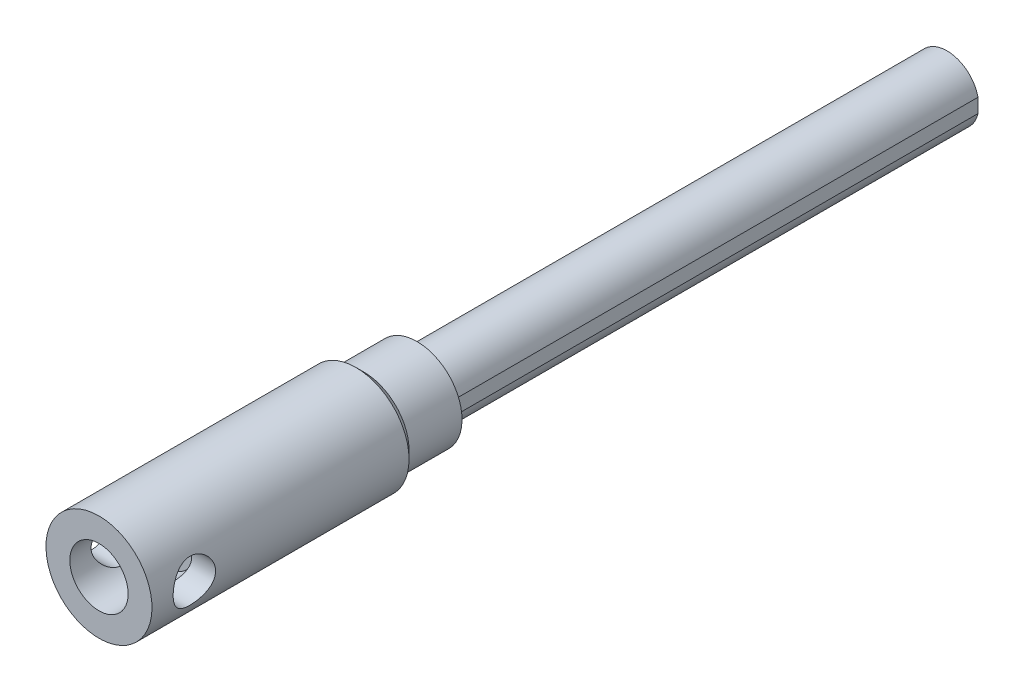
ISO-10303-21;
HEADER;
FILE_DESCRIPTION(('STEP AP214'),'2;1');
FILE_NAME('part.step','',(''),(''),'','','');
FILE_SCHEMA(('AUTOMOTIVE_DESIGN { 1 0 10303 214 1 1 1 1 }'));
ENDSEC;
DATA;
#1=APPLICATION_CONTEXT('core data for automotive mechanical design processes');
#2=APPLICATION_PROTOCOL_DEFINITION('international standard','automotive_design',2000,#1);
#3=PRODUCT_CONTEXT('',#1,'mechanical');
#4=PRODUCT('Part','Part','',(#3));
#5=PRODUCT_RELATED_PRODUCT_CATEGORY('part','',(#4));
#6=PRODUCT_DEFINITION_FORMATION('','',#4);
#7=PRODUCT_DEFINITION_CONTEXT('part definition',#1,'design');
#8=PRODUCT_DEFINITION('design','',#6,#7);
#9=PRODUCT_DEFINITION_SHAPE('','',#8);
#10=(LENGTH_UNIT() NAMED_UNIT(*) SI_UNIT(.MILLI.,.METRE.));
#11=(NAMED_UNIT(*) PLANE_ANGLE_UNIT() SI_UNIT($,.RADIAN.));
#12=(NAMED_UNIT(*) SI_UNIT($,.STERADIAN.) SOLID_ANGLE_UNIT());
#13=UNCERTAINTY_MEASURE_WITH_UNIT(LENGTH_MEASURE(1.E-05),#10,'distance_accuracy_value','');
#14=(GEOMETRIC_REPRESENTATION_CONTEXT(3) GLOBAL_UNCERTAINTY_ASSIGNED_CONTEXT((#13)) GLOBAL_UNIT_ASSIGNED_CONTEXT((#10,
#11,#12)) REPRESENTATION_CONTEXT('',''));
#15=CARTESIAN_POINT('',(0.,0.,0.));
#16=DIRECTION('',(0.,0.,1.));
#17=DIRECTION('',(1.,0.,0.));
#18=AXIS2_PLACEMENT_3D('',#15,#16,#17);
#19=CARTESIAN_POINT('',(-2.88675134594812,0.,144.));
#20=DIRECTION('',(0.866025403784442,-0.5,0.));
#21=DIRECTION('',(0.5,0.866025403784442,0.));
#22=AXIS2_PLACEMENT_3D('',#19,#20,#21);
#23=PLANE('',#22);
#24=DIRECTION('',(0.,0.,1.));
#25=VECTOR('',#24,1.);
#26=CARTESIAN_POINT('',(-1.44337567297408,2.5,144.));
#27=LINE('',#26,#25);
#28=CARTESIAN_POINT('',(-1.44337567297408,2.5,144.));
#29=VERTEX_POINT('',#28);
#30=CARTESIAN_POINT('',(-1.44337567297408,2.5,147.));
#31=VERTEX_POINT('',#30);
#32=EDGE_CURVE('E291',#29,#31,#27,.T.);
#33=ORIENTED_EDGE('',*,*,#32,.T.);
#34=DIRECTION('',(0.5,0.866025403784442,0.));
#35=VECTOR('',#34,1.);
#36=CARTESIAN_POINT('',(-2.88675134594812,0.,147.));
#37=LINE('',#36,#35);
#38=CARTESIAN_POINT('',(-2.88675134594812,0.,147.));
#39=VERTEX_POINT('',#38);
#40=EDGE_CURVE('E29',#39,#31,#37,.T.);
#41=ORIENTED_EDGE('',*,*,#40,.F.);
#42=DIRECTION('',(0.,0.,1.));
#43=VECTOR('',#42,1.);
#44=CARTESIAN_POINT('',(-2.88675134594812,0.,144.));
#45=LINE('',#44,#43);
#46=CARTESIAN_POINT('',(-2.88675134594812,0.,144.));
#47=VERTEX_POINT('',#46);
#48=EDGE_CURVE('E33',#47,#39,#45,.T.);
#49=ORIENTED_EDGE('',*,*,#48,.F.);
#50=DIRECTION('',(0.5,0.866025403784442,0.));
#51=VECTOR('',#50,1.);
#52=CARTESIAN_POINT('',(-2.88675134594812,0.,144.));
#53=LINE('',#52,#51);
#54=EDGE_CURVE('E252',#47,#29,#53,.T.);
#55=ORIENTED_EDGE('',*,*,#54,.T.);
#56=EDGE_LOOP('',(#33,#41,#49,#55));
#57=FACE_BOUND('',#56,.T.);
#58=ADVANCED_FACE('F14',(#57),#23,.T.);
#59=CARTESIAN_POINT('',(1.44337567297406,2.5,144.));
#60=DIRECTION('',(0.,1.,0.));
#61=DIRECTION('',(-1.,0.,0.));
#62=AXIS2_PLACEMENT_3D('',#59,#60,#61);
#63=PLANE('',#62);
#64=DIRECTION('',(0.,0.,1.));
#65=VECTOR('',#64,1.);
#66=CARTESIAN_POINT('',(1.44337567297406,2.5,144.));
#67=LINE('',#66,#65);
#68=CARTESIAN_POINT('',(1.44337567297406,2.5,144.));
#69=VERTEX_POINT('',#68);
#70=CARTESIAN_POINT('',(1.44337567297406,2.5,147.));
#71=VERTEX_POINT('',#70);
#72=EDGE_CURVE('E289',#69,#71,#67,.T.);
#73=ORIENTED_EDGE('',*,*,#72,.T.);
#74=DIRECTION('',(-1.,0.,0.));
#75=VECTOR('',#74,1.);
#76=CARTESIAN_POINT('',(1.44337567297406,2.5,147.));
#77=LINE('',#76,#75);
#78=EDGE_CURVE('E262',#71,#31,#77,.T.);
#79=ORIENTED_EDGE('',*,*,#78,.T.);
#80=ORIENTED_EDGE('',*,*,#32,.F.);
#81=DIRECTION('',(-1.,0.,0.));
#82=VECTOR('',#81,1.);
#83=CARTESIAN_POINT('',(1.44337567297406,2.5,144.));
#84=LINE('',#83,#82);
#85=EDGE_CURVE('E278',#69,#29,#84,.T.);
#86=ORIENTED_EDGE('',*,*,#85,.F.);
#87=EDGE_LOOP('',(#73,#79,#80,#86));
#88=FACE_BOUND('',#87,.T.);
#89=ADVANCED_FACE('F166',(#88),#63,.F.);
#90=CARTESIAN_POINT('',(2.88675134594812,0.,144.));
#91=DIRECTION('',(0.866025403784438,0.5,0.));
#92=DIRECTION('',(-0.5,0.866025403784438,0.));
#93=AXIS2_PLACEMENT_3D('',#90,#91,#92);
#94=PLANE('',#93);
#95=DIRECTION('',(0.,0.,1.));
#96=VECTOR('',#95,1.);
#97=CARTESIAN_POINT('',(2.88675134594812,0.,144.));
#98=LINE('',#97,#96);
#99=CARTESIAN_POINT('',(2.88675134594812,0.,144.));
#100=VERTEX_POINT('',#99);
#101=CARTESIAN_POINT('',(2.88675134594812,0.,147.));
#102=VERTEX_POINT('',#101);
#103=EDGE_CURVE('E287',#100,#102,#98,.T.);
#104=ORIENTED_EDGE('',*,*,#103,.T.);
#105=DIRECTION('',(-0.5,0.866025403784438,0.));
#106=VECTOR('',#105,1.);
#107=CARTESIAN_POINT('',(2.88675134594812,0.,147.));
#108=LINE('',#107,#106);
#109=EDGE_CURVE('E259',#102,#71,#108,.T.);
#110=ORIENTED_EDGE('',*,*,#109,.T.);
#111=ORIENTED_EDGE('',*,*,#72,.F.);
#112=DIRECTION('',(-0.5,0.866025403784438,0.));
#113=VECTOR('',#112,1.);
#114=CARTESIAN_POINT('',(2.88675134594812,0.,144.));
#115=LINE('',#114,#113);
#116=EDGE_CURVE('E275',#100,#69,#115,.T.);
#117=ORIENTED_EDGE('',*,*,#116,.F.);
#118=EDGE_LOOP('',(#104,#110,#111,#117));
#119=FACE_BOUND('',#118,.T.);
#120=ADVANCED_FACE('F171',(#119),#94,.F.);
#121=CARTESIAN_POINT('',(2.88675134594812,0.,144.));
#122=DIRECTION('',(-0.866025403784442,0.5,0.));
#123=DIRECTION('',(-0.5,-0.866025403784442,0.));
#124=AXIS2_PLACEMENT_3D('',#121,#122,#123);
#125=PLANE('',#124);
#126=DIRECTION('',(0.,0.,1.));
#127=VECTOR('',#126,1.);
#128=CARTESIAN_POINT('',(1.44337567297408,-2.5,144.));
#129=LINE('',#128,#127);
#130=CARTESIAN_POINT('',(1.44337567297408,-2.5,144.));
#131=VERTEX_POINT('',#130);
#132=CARTESIAN_POINT('',(1.44337567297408,-2.5,147.));
#133=VERTEX_POINT('',#132);
#134=EDGE_CURVE('E285',#131,#133,#129,.T.);
#135=ORIENTED_EDGE('',*,*,#134,.T.);
#136=DIRECTION('',(-0.5,-0.866025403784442,0.));
#137=VECTOR('',#136,1.);
#138=CARTESIAN_POINT('',(2.88675134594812,0.,147.));
#139=LINE('',#138,#137);
#140=EDGE_CURVE('E256',#102,#133,#139,.T.);
#141=ORIENTED_EDGE('',*,*,#140,.F.);
#142=ORIENTED_EDGE('',*,*,#103,.F.);
#143=DIRECTION('',(-0.5,-0.866025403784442,0.));
#144=VECTOR('',#143,1.);
#145=CARTESIAN_POINT('',(2.88675134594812,0.,144.));
#146=LINE('',#145,#144);
#147=EDGE_CURVE('E272',#100,#131,#146,.T.);
#148=ORIENTED_EDGE('',*,*,#147,.T.);
#149=EDGE_LOOP('',(#135,#141,#142,#148));
#150=FACE_BOUND('',#149,.T.);
#151=ADVANCED_FACE('F184',(#150),#125,.T.);
#152=CARTESIAN_POINT('',(-1.44337567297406,-2.5,144.));
#153=DIRECTION('',(0.,-1.,0.));
#154=DIRECTION('',(1.,0.,0.));
#155=AXIS2_PLACEMENT_3D('',#152,#153,#154);
#156=PLANE('',#155);
#157=DIRECTION('',(0.,0.,1.));
#158=VECTOR('',#157,1.);
#159=CARTESIAN_POINT('',(-1.44337567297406,-2.5,144.));
#160=LINE('',#159,#158);
#161=CARTESIAN_POINT('',(-1.44337567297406,-2.5,144.));
#162=VERTEX_POINT('',#161);
#163=CARTESIAN_POINT('',(-1.44337567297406,-2.5,147.));
#164=VERTEX_POINT('',#163);
#165=EDGE_CURVE('E283',#162,#164,#160,.T.);
#166=ORIENTED_EDGE('',*,*,#165,.T.);
#167=DIRECTION('',(1.,0.,0.));
#168=VECTOR('',#167,1.);
#169=CARTESIAN_POINT('',(-1.44337567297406,-2.5,147.));
#170=LINE('',#169,#168);
#171=EDGE_CURVE('E253',#164,#133,#170,.T.);
#172=ORIENTED_EDGE('',*,*,#171,.T.);
#173=ORIENTED_EDGE('',*,*,#134,.F.);
#174=DIRECTION('',(1.,0.,0.));
#175=VECTOR('',#174,1.);
#176=CARTESIAN_POINT('',(-1.44337567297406,-2.5,144.));
#177=LINE('',#176,#175);
#178=EDGE_CURVE('E269',#162,#131,#177,.T.);
#179=ORIENTED_EDGE('',*,*,#178,.F.);
#180=EDGE_LOOP('',(#166,#172,#173,#179));
#181=FACE_BOUND('',#180,.T.);
#182=ADVANCED_FACE('F180',(#181),#156,.F.);
#183=CARTESIAN_POINT('',(-2.88675134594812,0.,144.));
#184=DIRECTION('',(-0.866025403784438,-0.5,0.));
#185=DIRECTION('',(0.5,-0.866025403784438,0.));
#186=AXIS2_PLACEMENT_3D('',#183,#184,#185);
#187=PLANE('',#186);
#188=DIRECTION('',(0.5,-0.866025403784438,0.));
#189=VECTOR('',#188,1.);
#190=CARTESIAN_POINT('',(-2.88675134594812,0.,144.));
#191=LINE('',#190,#189);
#192=EDGE_CURVE('E266',#47,#162,#191,.T.);
#193=ORIENTED_EDGE('',*,*,#192,.F.);
#194=ORIENTED_EDGE('',*,*,#48,.T.);
#195=DIRECTION('',(0.5,-0.866025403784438,0.));
#196=VECTOR('',#195,1.);
#197=CARTESIAN_POINT('',(-2.88675134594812,0.,147.));
#198=LINE('',#197,#196);
#199=EDGE_CURVE('E249',#39,#164,#198,.T.);
#200=ORIENTED_EDGE('',*,*,#199,.T.);
#201=ORIENTED_EDGE('',*,*,#165,.F.);
#202=EDGE_LOOP('',(#193,#194,#200,#201));
#203=FACE_BOUND('',#202,.T.);
#204=ADVANCED_FACE('F177',(#203),#187,.F.);
#205=CARTESIAN_POINT('',(-1.44337567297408,2.5,144.));
#206=DIRECTION('',(0.,0.,1.));
#207=DIRECTION('',(0.,1.,0.));
#208=AXIS2_PLACEMENT_3D('',#205,#206,#207);
#209=PLANE('',#208);
#210=ORIENTED_EDGE('',*,*,#54,.F.);
#211=ORIENTED_EDGE('',*,*,#192,.T.);
#212=ORIENTED_EDGE('',*,*,#178,.T.);
#213=ORIENTED_EDGE('',*,*,#147,.F.);
#214=ORIENTED_EDGE('',*,*,#116,.T.);
#215=ORIENTED_EDGE('',*,*,#85,.T.);
#216=EDGE_LOOP('',(#210,#211,#212,#213,#214,#215));
#217=FACE_BOUND('',#216,.T.);
#218=ADVANCED_FACE('F176',(#217),#209,.T.);
#219=CARTESIAN_POINT('',(0.,0.,147.));
#220=DIRECTION('',(0.,0.,1.));
#221=DIRECTION('',(0.,1.,0.));
#222=AXIS2_PLACEMENT_3D('',#219,#220,#221);
#223=PLANE('',#222);
#224=CARTESIAN_POINT('',(0.,0.,147.));
#225=DIRECTION('',(0.,0.,1.));
#226=DIRECTION('',(0.,1.,0.));
#227=AXIS2_PLACEMENT_3D('',#224,#225,#226);
#228=CIRCLE('',#227,5.);
#229=CARTESIAN_POINT('',(0.,5.,147.));
#230=VERTEX_POINT('',#229);
#231=EDGE_CURVE('E9',#230,#230,#228,.T.);
#232=ORIENTED_EDGE('',*,*,#231,.T.);
#233=EDGE_LOOP('',(#232));
#234=FACE_BOUND('',#233,.T.);
#235=ORIENTED_EDGE('',*,*,#199,.F.);
#236=ORIENTED_EDGE('',*,*,#40,.T.);
#237=ORIENTED_EDGE('',*,*,#78,.F.);
#238=ORIENTED_EDGE('',*,*,#109,.F.);
#239=ORIENTED_EDGE('',*,*,#140,.T.);
#240=ORIENTED_EDGE('',*,*,#171,.F.);
#241=EDGE_LOOP('',(#235,#236,#237,#238,#239,#240));
#242=FACE_BOUND('',#241,.T.);
#243=ADVANCED_FACE('F16',(#234,#242),#223,.T.);
#244=CARTESIAN_POINT('',(0.,0.,131.));
#245=DIRECTION('',(0.,0.,1.));
#246=DIRECTION('',(0.,1.,0.));
#247=AXIS2_PLACEMENT_3D('',#244,#245,#246);
#248=CYLINDRICAL_SURFACE('',#247,5.);
#249=CARTESIAN_POINT('',(0.,0.,141.));
#250=DIRECTION('',(0.,0.,1.));
#251=DIRECTION('',(0.,1.,0.));
#252=AXIS2_PLACEMENT_3D('',#249,#250,#251);
#253=CIRCLE('',#252,5.);
#254=CARTESIAN_POINT('',(0.,5.,141.));
#255=VERTEX_POINT('',#254);
#256=EDGE_CURVE('E22',#255,#255,#253,.T.);
#257=ORIENTED_EDGE('',*,*,#256,.T.);
#258=EDGE_LOOP('',(#257));
#259=FACE_BOUND('',#258,.T.);
#260=ORIENTED_EDGE('',*,*,#231,.F.);
#261=EDGE_LOOP('',(#260));
#262=FACE_BOUND('',#261,.T.);
#263=ADVANCED_FACE('F191',(#259,#262),#248,.T.);
#264=CARTESIAN_POINT('',(0.,0.,0.));
#265=DIRECTION('',(0.,0.,1.));
#266=DIRECTION('',(-1.,0.,0.));
#267=AXIS2_PLACEMENT_3D('',#264,#265,#266);
#268=PLANE('',#267);
#269=DIRECTION('',(0.,-1.,0.));
#270=VECTOR('',#269,1.);
#271=CARTESIAN_POINT('',(5.85,-1.33322916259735,0.));
#272=LINE('',#271,#270);
#273=CARTESIAN_POINT('',(5.85,1.33322916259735,0.));
#274=VERTEX_POINT('',#273);
#275=CARTESIAN_POINT('',(5.85,-1.33322916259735,0.));
#276=VERTEX_POINT('',#275);
#277=EDGE_CURVE('E91',#274,#276,#272,.T.);
#278=ORIENTED_EDGE('',*,*,#277,.T.);
#279=CARTESIAN_POINT('',(0.,0.,0.));
#280=DIRECTION('',(0.,0.,1.));
#281=DIRECTION('',(-1.,0.,0.));
#282=AXIS2_PLACEMENT_3D('',#279,#280,#281);
#283=CIRCLE('',#282,6.);
#284=EDGE_CURVE('E83',#274,#276,#283,.T.);
#285=ORIENTED_EDGE('',*,*,#284,.F.);
#286=EDGE_LOOP('',(#278,#285));
#287=FACE_BOUND('',#286,.T.);
#288=ADVANCED_FACE('F95',(#287),#268,.F.);
#289=CARTESIAN_POINT('',(5.85,-1.33322916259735,120.));
#290=DIRECTION('',(1.,0.,0.));
#291=DIRECTION('',(0.,0.,1.));
#292=AXIS2_PLACEMENT_3D('',#289,#290,#291);
#293=PLANE('',#292);
#294=DIRECTION('',(0.,1.,0.));
#295=VECTOR('',#294,1.);
#296=CARTESIAN_POINT('',(5.85,8.5,100.));
#297=LINE('',#296,#295);
#298=CARTESIAN_POINT('',(5.85,-1.33322916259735,100.));
#299=VERTEX_POINT('',#298);
#300=CARTESIAN_POINT('',(5.85,1.33322916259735,100.));
#301=VERTEX_POINT('',#300);
#302=EDGE_CURVE('E246',#299,#301,#297,.T.);
#303=ORIENTED_EDGE('',*,*,#302,.F.);
#304=DIRECTION('',(0.,0.,-1.));
#305=VECTOR('',#304,1.);
#306=CARTESIAN_POINT('',(5.85,-1.33322916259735,120.));
#307=LINE('',#306,#305);
#308=EDGE_CURVE('E88',#299,#276,#307,.T.);
#309=ORIENTED_EDGE('',*,*,#308,.T.);
#310=ORIENTED_EDGE('',*,*,#277,.F.);
#311=DIRECTION('',(0.,0.,-1.));
#312=VECTOR('',#311,1.);
#313=CARTESIAN_POINT('',(5.85,1.33322916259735,120.));
#314=LINE('',#313,#312);
#315=EDGE_CURVE('E78',#301,#274,#314,.T.);
#316=ORIENTED_EDGE('',*,*,#315,.F.);
#317=EDGE_LOOP('',(#303,#309,#310,#316));
#318=FACE_BOUND('',#317,.T.);
#319=ADVANCED_FACE('F92',(#318),#293,.T.);
#320=CARTESIAN_POINT('',(0.,0.,120.));
#321=DIRECTION('',(0.,0.,-1.));
#322=DIRECTION('',(1.,0.,0.));
#323=AXIS2_PLACEMENT_3D('',#320,#321,#322);
#324=CYLINDRICAL_SURFACE('',#323,6.);
#325=ORIENTED_EDGE('',*,*,#308,.F.);
#326=CARTESIAN_POINT('',(0.,0.,100.));
#327=DIRECTION('',(0.,0.,1.));
#328=DIRECTION('',(2.05103273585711E-10,-1.,0.));
#329=AXIS2_PLACEMENT_3D('',#326,#327,#328);
#330=CIRCLE('',#329,6.);
#331=EDGE_CURVE('E84',#299,#301,#330,.F.);
#332=ORIENTED_EDGE('',*,*,#331,.T.);
#333=ORIENTED_EDGE('',*,*,#315,.T.);
#334=ORIENTED_EDGE('',*,*,#284,.T.);
#335=EDGE_LOOP('',(#325,#332,#333,#334));
#336=FACE_BOUND('',#335,.T.);
#337=ADVANCED_FACE('F81',(#336),#324,.T.);
#338=CARTESIAN_POINT('',(0.,8.5,100.));
#339=DIRECTION('',(0.,0.,1.));
#340=DIRECTION('',(0.,-1.,0.));
#341=AXIS2_PLACEMENT_3D('',#338,#339,#340);
#342=PLANE('',#341);
#343=CARTESIAN_POINT('',(0.,0.,100.));
#344=DIRECTION('',(0.,0.,-1.));
#345=DIRECTION('',(0.,1.,0.));
#346=AXIS2_PLACEMENT_3D('',#343,#344,#345);
#347=CIRCLE('',#346,8.5);
#348=CARTESIAN_POINT('',(0.,8.5,100.));
#349=VERTEX_POINT('',#348);
#350=EDGE_CURVE('E222',#349,#349,#347,.T.);
#351=ORIENTED_EDGE('',*,*,#350,.T.);
#352=EDGE_LOOP('',(#351));
#353=FACE_BOUND('',#352,.T.);
#354=ORIENTED_EDGE('',*,*,#331,.F.);
#355=ORIENTED_EDGE('',*,*,#302,.T.);
#356=EDGE_LOOP('',(#354,#355));
#357=FACE_BOUND('',#356,.T.);
#358=ADVANCED_FACE('F126',(#353,#357),#342,.F.);
#359=CARTESIAN_POINT('',(0.,0.,100.));
#360=DIRECTION('',(0.,0.,-1.));
#361=DIRECTION('',(0.,1.,0.));
#362=AXIS2_PLACEMENT_3D('',#359,#360,#361);
#363=CYLINDRICAL_SURFACE('',#362,8.5);
#364=ORIENTED_EDGE('',*,*,#350,.F.);
#365=EDGE_LOOP('',(#364));
#366=FACE_BOUND('',#365,.T.);
#367=CARTESIAN_POINT('',(0.,0.,110.));
#368=DIRECTION('',(0.,0.,-1.));
#369=DIRECTION('',(0.,1.,0.));
#370=AXIS2_PLACEMENT_3D('',#367,#368,#369);
#371=CIRCLE('',#370,8.5);
#372=CARTESIAN_POINT('',(0.,8.5,110.));
#373=VERTEX_POINT('',#372);
#374=EDGE_CURVE('E220',#373,#373,#371,.T.);
#375=ORIENTED_EDGE('',*,*,#374,.T.);
#376=EDGE_LOOP('',(#375));
#377=FACE_BOUND('',#376,.T.);
#378=ADVANCED_FACE('F151',(#366,#377),#363,.T.);
#379=CARTESIAN_POINT('',(0.,0.,110.));
#380=DIRECTION('',(0.,0.,1.));
#381=DIRECTION('',(0.,-1.,0.));
#382=AXIS2_PLACEMENT_3D('',#379,#380,#381);
#383=CONICAL_SURFACE('',#382,8.5,0.785398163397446);
#384=CARTESIAN_POINT('',(0.,0.,111.5));
#385=DIRECTION('',(0.,0.,1.));
#386=DIRECTION('',(0.,-1.,0.));
#387=AXIS2_PLACEMENT_3D('',#384,#385,#386);
#388=CIRCLE('',#387,10.);
#389=CARTESIAN_POINT('',(0.,-10.,111.5));
#390=VERTEX_POINT('',#389);
#391=EDGE_CURVE('E145',#390,#390,#388,.T.);
#392=ORIENTED_EDGE('',*,*,#391,.F.);
#393=EDGE_LOOP('',(#392));
#394=FACE_BOUND('',#393,.T.);
#395=ORIENTED_EDGE('',*,*,#374,.F.);
#396=EDGE_LOOP('',(#395));
#397=FACE_BOUND('',#396,.T.);
#398=ADVANCED_FACE('F124',(#394,#397),#383,.T.);
#399=CARTESIAN_POINT('',(0.,0.,100.));
#400=DIRECTION('',(0.,0.,-1.));
#401=DIRECTION('',(0.,1.,0.));
#402=AXIS2_PLACEMENT_3D('',#399,#400,#401);
#403=CYLINDRICAL_SURFACE('',#402,10.);
#404=ORIENTED_EDGE('',*,*,#391,.T.);
#405=EDGE_LOOP('',(#404));
#406=FACE_BOUND('',#405,.T.);
#407=CARTESIAN_POINT('',(-10.,0.,156.));
#408=CARTESIAN_POINT('',(-9.99999886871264,-0.107549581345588,155.999998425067));
#409=CARTESIAN_POINT('',(-9.99825999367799,-0.215132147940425,155.99565632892));
#410=CARTESIAN_POINT('',(-9.99134740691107,-0.429535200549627,155.978326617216));
#411=CARTESIAN_POINT('',(-9.98617152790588,-0.536355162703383,155.965333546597));
#412=CARTESIAN_POINT('',(-9.97250573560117,-0.748635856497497,155.930791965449));
#413=CARTESIAN_POINT('',(-9.96400865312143,-0.854093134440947,155.90922494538));
#414=CARTESIAN_POINT('',(-9.94393017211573,-1.06266761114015,155.857758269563));
#415=CARTESIAN_POINT('',(-9.93234752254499,-1.16578384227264,155.827855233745));
#416=CARTESIAN_POINT('',(-9.89349112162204,-1.46979509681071,155.726277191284));
#417=CARTESIAN_POINT('',(-9.86204458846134,-1.66629107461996,155.642578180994));
#418=CARTESIAN_POINT('',(-9.79113035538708,-2.04217417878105,155.44595378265));
#419=CARTESIAN_POINT('',(-9.75166544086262,-2.221567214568,155.333038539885));
#420=CARTESIAN_POINT('',(-9.6666182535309,-2.56699339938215,155.075531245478));
#421=CARTESIAN_POINT('',(-9.62084608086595,-2.73212223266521,154.929787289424));
#422=CARTESIAN_POINT('',(-9.52921139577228,-3.03635232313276,154.613199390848));
#423=CARTESIAN_POINT('',(-9.48334885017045,-3.17544084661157,154.442343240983));
#424=CARTESIAN_POINT('',(-9.39445587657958,-3.42974847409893,154.071144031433));
#425=CARTESIAN_POINT('',(-9.35164233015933,-3.5436297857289,153.869827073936));
#426=CARTESIAN_POINT('',(-9.27667293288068,-3.7355096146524,153.448927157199));
#427=CARTESIAN_POINT('',(-9.24451202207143,-3.81352517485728,153.229352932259));
#428=CARTESIAN_POINT('',(-9.19652715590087,-3.92779760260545,152.788575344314));
#429=CARTESIAN_POINT('',(-9.18002840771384,-3.96578791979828,152.567897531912));
#430=CARTESIAN_POINT('',(-9.16328008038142,-4.00434593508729,152.122730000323));
#431=CARTESIAN_POINT('',(-9.16302251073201,-4.00493203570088,151.898242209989));
#432=CARTESIAN_POINT('',(-9.17821000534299,-3.96997873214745,151.468486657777));
#433=CARTESIAN_POINT('',(-9.19256349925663,-3.9369506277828,151.262968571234));
#434=CARTESIAN_POINT('',(-9.23352375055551,-3.83989376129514,150.86068088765));
#435=CARTESIAN_POINT('',(-9.26013264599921,-3.77585958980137,150.663912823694));
#436=CARTESIAN_POINT('',(-9.32318970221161,-3.61738946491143,150.279964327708));
#437=CARTESIAN_POINT('',(-9.35982758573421,-3.52235972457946,150.093061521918));
#438=CARTESIAN_POINT('',(-9.43876232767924,-3.30501292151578,149.73716836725));
#439=CARTESIAN_POINT('',(-9.4810613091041,-3.18268561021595,149.568184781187));
#440=CARTESIAN_POINT('',(-9.57053473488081,-2.90310119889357,149.239180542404));
#441=CARTESIAN_POINT('',(-9.61783329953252,-2.74387492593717,149.08086254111));
#442=CARTESIAN_POINT('',(-9.70919649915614,-2.40062885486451,148.792631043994));
#443=CARTESIAN_POINT('',(-9.75326048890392,-2.21660413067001,148.662723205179));
#444=CARTESIAN_POINT('',(-9.83429362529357,-1.8241553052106,148.432765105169));
#445=CARTESIAN_POINT('',(-9.87110540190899,-1.61532098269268,148.333355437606));
#446=CARTESIAN_POINT('',(-9.93229656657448,-1.18204753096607,148.171664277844));
#447=CARTESIAN_POINT('',(-9.95668226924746,-0.957616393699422,148.109363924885));
#448=CARTESIAN_POINT('',(-9.98912279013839,-0.513791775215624,148.027103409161));
#449=CARTESIAN_POINT('',(-9.99805891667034,-0.294886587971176,148.004855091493));
#450=CARTESIAN_POINT('',(-10.0013695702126,0.143690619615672,147.996573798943));
#451=CARTESIAN_POINT('',(-9.99574787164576,0.363362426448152,148.010531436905));
#452=CARTESIAN_POINT('',(-9.97115134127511,0.786865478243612,148.072583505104));
#453=CARTESIAN_POINT('',(-9.95278782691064,0.990964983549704,148.119115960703));
#454=CARTESIAN_POINT('',(-9.90518882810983,1.3882708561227,148.242871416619));
#455=CARTESIAN_POINT('',(-9.87595194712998,1.5814758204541,148.320098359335));
#456=CARTESIAN_POINT('',(-9.80833189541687,1.9581575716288,148.505569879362));
#457=CARTESIAN_POINT('',(-9.76969631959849,2.14115604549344,148.614690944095));
#458=CARTESIAN_POINT('',(-9.68746729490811,2.48688718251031,148.859880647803));
#459=CARTESIAN_POINT('',(-9.64387186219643,2.64961168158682,148.995960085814));
#460=CARTESIAN_POINT('',(-9.55290235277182,2.96144608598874,149.301740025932));
#461=CARTESIAN_POINT('',(-9.50546882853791,3.10894786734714,149.473067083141));
#462=CARTESIAN_POINT('',(-9.41483345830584,3.37350239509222,149.83888016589));
#463=CARTESIAN_POINT('',(-9.37163231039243,3.49055012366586,150.033370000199));
#464=CARTESIAN_POINT('',(-9.29428599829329,3.69161500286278,150.442923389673));
#465=CARTESIAN_POINT('',(-9.26023261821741,3.77530118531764,150.658168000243));
#466=CARTESIAN_POINT('',(-9.20647346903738,3.90459244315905,151.101467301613));
#467=CARTESIAN_POINT('',(-9.18675711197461,3.95022562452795,151.329512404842));
#468=CARTESIAN_POINT('',(-9.1654351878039,3.99943122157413,151.774255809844));
#469=CARTESIAN_POINT('',(-9.16262842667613,4.00579411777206,151.990589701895));
#470=CARTESIAN_POINT('',(-9.17229671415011,3.9836063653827,152.421089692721));
#471=CARTESIAN_POINT('',(-9.18476982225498,3.95506015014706,152.635256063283));
#472=CARTESIAN_POINT('',(-9.22253300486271,3.86614256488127,153.04666446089));
#473=CARTESIAN_POINT('',(-9.2472967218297,3.80707437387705,153.244240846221));
#474=CARTESIAN_POINT('',(-9.30647993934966,3.66001151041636,153.62675696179));
#475=CARTESIAN_POINT('',(-9.34090210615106,3.57200884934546,153.811693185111));
#476=CARTESIAN_POINT('',(-9.41797252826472,3.36374310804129,154.175220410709));
#477=CARTESIAN_POINT('',(-9.46097893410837,3.24192140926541,154.352841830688));
#478=CARTESIAN_POINT('',(-9.54927479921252,2.97179350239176,154.685982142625));
#479=CARTESIAN_POINT('',(-9.59456494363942,2.8234793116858,154.84149434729));
#480=CARTESIAN_POINT('',(-9.68587647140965,2.49297412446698,155.136423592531));
#481=CARTESIAN_POINT('',(-9.73175488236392,2.30921017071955,155.274143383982));
#482=CARTESIAN_POINT('',(-9.7949502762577,2.01716584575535,155.456048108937));
#483=CARTESIAN_POINT('',(-9.81509269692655,1.91699501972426,155.512607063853));
#484=CARTESIAN_POINT('',(-9.85294835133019,1.7118011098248,155.617037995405));
#485=CARTESIAN_POINT('',(-9.87066269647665,1.60678027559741,155.664913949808));
#486=CARTESIAN_POINT('',(-9.90285599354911,1.39454646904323,155.750747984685));
#487=CARTESIAN_POINT('',(-9.91738778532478,1.28740777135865,155.788870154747));
#488=CARTESIAN_POINT('',(-9.94319722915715,1.06995577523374,155.855921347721));
#489=CARTESIAN_POINT('',(-9.95447639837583,0.959643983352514,155.88485465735));
#490=CARTESIAN_POINT('',(-9.973433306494,0.736945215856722,155.933174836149));
#491=CARTESIAN_POINT('',(-9.98112017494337,0.624564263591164,155.952585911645));
#492=CARTESIAN_POINT('',(-9.99270031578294,0.398419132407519,155.981738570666));
#493=CARTESIAN_POINT('',(-9.99659628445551,0.284655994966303,155.991487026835));
#494=CARTESIAN_POINT('',(-9.99951445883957,0.113830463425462,155.998785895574));
#495=CARTESIAN_POINT('',(-10.0000005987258,0.0569198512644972,156.000000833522));
#496=CARTESIAN_POINT('',(-10.,0.,156.));
#497=B_SPLINE_CURVE_WITH_KNOTS('',3,(#407,#408,#409,#410,#411,#412,#413,#414,#415,#416,#417,
#418,#419,#420,#421,#422,#423,#424,#425,#426,#427,#428,#429,#430,#431,#432,#433,#434,#435,#436,
#437,#438,#439,#440,#441,#442,#443,#444,#445,#446,#447,#448,#449,#450,#451,#452,#453,#454,#455,
#456,#457,#458,#459,#460,#461,#462,#463,#464,#465,#466,#467,#468,#469,#470,#471,#472,#473,#474,
#475,#476,#477,#478,#479,#480,#481,#482,#483,#484,#485,#486,#487,#488,#489,#490,#491,#492,#493,
#494,#495,#496),.UNSPECIFIED.,.T.,.F.,(4,2,2,2,2,2,2,2,2,2,2,2,2,2,2,2,2,2,2,2,2,2,2,2,2,2,2,2,
2,2,2,2,2,2,2,2,2,2,2,2,2,2,2,2,4),(0.,0.322603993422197,0.645411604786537,0.968919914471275,
1.29255959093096,1.93701523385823,2.58124739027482,3.25313995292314,3.92536021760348,
4.62749749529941,5.32930078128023,5.99927442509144,6.66891844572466,7.29195888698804,
7.91510806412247,8.55097484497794,9.18708075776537,9.87235930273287,10.5577741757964,
11.2567305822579,11.9553314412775,12.6125760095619,13.2696501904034,13.897201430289,
14.5248332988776,15.1716625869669,15.818751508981,16.5085618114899,17.1984856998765,
17.8950932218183,18.5911857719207,19.2371857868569,19.8831037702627,20.5034786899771,
21.1240250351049,21.7801016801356,22.4363763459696,23.1352007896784,23.4851924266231,
23.8350233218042,24.1785111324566,24.5218384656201,24.8642884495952,25.2064946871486,
25.3772305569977),.UNSPECIFIED.);
#498=CARTESIAN_POINT('',(-10.,0.,156.));
#499=VERTEX_POINT('',#498);
#500=EDGE_CURVE('E139',#499,#499,#497,.T.);
#501=ORIENTED_EDGE('',*,*,#500,.T.);
#502=EDGE_LOOP('',(#501));
#503=FACE_BOUND('',#502,.T.);
#504=CARTESIAN_POINT('',(10.,0.,156.));
#505=CARTESIAN_POINT('',(9.99999886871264,0.107549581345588,155.999998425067));
#506=CARTESIAN_POINT('',(9.99825999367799,0.215132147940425,155.99565632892));
#507=CARTESIAN_POINT('',(9.99134740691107,0.429535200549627,155.978326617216));
#508=CARTESIAN_POINT('',(9.98617152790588,0.536355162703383,155.965333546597));
#509=CARTESIAN_POINT('',(9.97250573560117,0.748635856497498,155.930791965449));
#510=CARTESIAN_POINT('',(9.96400865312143,0.854093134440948,155.90922494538));
#511=CARTESIAN_POINT('',(9.94393017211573,1.06266761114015,155.857758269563));
#512=CARTESIAN_POINT('',(9.93234752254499,1.16578384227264,155.827855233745));
#513=CARTESIAN_POINT('',(9.89349112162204,1.46979509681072,155.726277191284));
#514=CARTESIAN_POINT('',(9.86204458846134,1.66629107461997,155.642578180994));
#515=CARTESIAN_POINT('',(9.79113035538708,2.04217417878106,155.44595378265));
#516=CARTESIAN_POINT('',(9.75166544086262,2.221567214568,155.333038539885));
#517=CARTESIAN_POINT('',(9.6666182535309,2.56699339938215,155.075531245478));
#518=CARTESIAN_POINT('',(9.62084608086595,2.73212223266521,154.929787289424));
#519=CARTESIAN_POINT('',(9.52921139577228,3.03635232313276,154.613199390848));
#520=CARTESIAN_POINT('',(9.48334885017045,3.17544084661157,154.442343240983));
#521=CARTESIAN_POINT('',(9.39445587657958,3.42974847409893,154.071144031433));
#522=CARTESIAN_POINT('',(9.35164233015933,3.5436297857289,153.869827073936));
#523=CARTESIAN_POINT('',(9.27667293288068,3.7355096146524,153.448927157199));
#524=CARTESIAN_POINT('',(9.24451202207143,3.81352517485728,153.229352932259));
#525=CARTESIAN_POINT('',(9.19652715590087,3.92779760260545,152.788575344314));
#526=CARTESIAN_POINT('',(9.18002840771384,3.96578791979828,152.567897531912));
#527=CARTESIAN_POINT('',(9.16328008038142,4.00434593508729,152.122730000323));
#528=CARTESIAN_POINT('',(9.16302251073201,4.00493203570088,151.898242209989));
#529=CARTESIAN_POINT('',(9.17821000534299,3.96997873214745,151.468486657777));
#530=CARTESIAN_POINT('',(9.19256349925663,3.9369506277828,151.262968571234));
#531=CARTESIAN_POINT('',(9.23352375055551,3.83989376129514,150.86068088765));
#532=CARTESIAN_POINT('',(9.26013264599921,3.77585958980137,150.663912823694));
#533=CARTESIAN_POINT('',(9.32318970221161,3.61738946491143,150.279964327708));
#534=CARTESIAN_POINT('',(9.35982758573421,3.52235972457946,150.093061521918));
#535=CARTESIAN_POINT('',(9.43876232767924,3.30501292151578,149.73716836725));
#536=CARTESIAN_POINT('',(9.4810613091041,3.18268561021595,149.568184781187));
#537=CARTESIAN_POINT('',(9.57053473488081,2.90310119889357,149.239180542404));
#538=CARTESIAN_POINT('',(9.61783329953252,2.74387492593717,149.08086254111));
#539=CARTESIAN_POINT('',(9.70919649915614,2.4006288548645,148.792631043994));
#540=CARTESIAN_POINT('',(9.75326048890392,2.21660413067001,148.662723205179));
#541=CARTESIAN_POINT('',(9.83429362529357,1.82415530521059,148.432765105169));
#542=CARTESIAN_POINT('',(9.87110540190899,1.61532098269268,148.333355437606));
#543=CARTESIAN_POINT('',(9.93229656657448,1.18204753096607,148.171664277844));
#544=CARTESIAN_POINT('',(9.95668226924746,0.957616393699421,148.109363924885));
#545=CARTESIAN_POINT('',(9.98912279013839,0.513791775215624,148.027103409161));
#546=CARTESIAN_POINT('',(9.99805891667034,0.294886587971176,148.004855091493));
#547=CARTESIAN_POINT('',(10.0013695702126,-0.143690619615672,147.996573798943));
#548=CARTESIAN_POINT('',(9.99574787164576,-0.363362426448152,148.010531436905));
#549=CARTESIAN_POINT('',(9.97115134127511,-0.786865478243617,148.072583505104));
#550=CARTESIAN_POINT('',(9.95278782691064,-0.990964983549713,148.119115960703));
#551=CARTESIAN_POINT('',(9.90518882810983,-1.38827085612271,148.242871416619));
#552=CARTESIAN_POINT('',(9.87595194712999,-1.5814758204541,148.320098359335));
#553=CARTESIAN_POINT('',(9.80833189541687,-1.95815757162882,148.505569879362));
#554=CARTESIAN_POINT('',(9.76969631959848,-2.14115604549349,148.614690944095));
#555=CARTESIAN_POINT('',(9.6874672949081,-2.48688718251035,148.859880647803));
#556=CARTESIAN_POINT('',(9.64387186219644,-2.6496116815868,148.995960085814));
#557=CARTESIAN_POINT('',(9.55290235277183,-2.96144608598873,149.301740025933));
#558=CARTESIAN_POINT('',(9.5054688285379,-3.10894786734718,149.473067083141));
#559=CARTESIAN_POINT('',(9.41483345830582,-3.37350239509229,149.83888016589));
#560=CARTESIAN_POINT('',(9.37163231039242,-3.49055012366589,150.033370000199));
#561=CARTESIAN_POINT('',(9.29428599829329,-3.69161500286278,150.442923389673));
#562=CARTESIAN_POINT('',(9.26023261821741,-3.77530118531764,150.658168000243));
#563=CARTESIAN_POINT('',(9.20647346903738,-3.90459244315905,151.101467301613));
#564=CARTESIAN_POINT('',(9.18675711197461,-3.95022562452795,151.329512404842));
#565=CARTESIAN_POINT('',(9.16543518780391,-3.99943122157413,151.774255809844));
#566=CARTESIAN_POINT('',(9.16262842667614,-4.00579411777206,151.990589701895));
#567=CARTESIAN_POINT('',(9.17229671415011,-3.9836063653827,152.421089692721));
#568=CARTESIAN_POINT('',(9.18476982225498,-3.95506015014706,152.635256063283));
#569=CARTESIAN_POINT('',(9.22253300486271,-3.86614256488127,153.04666446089));
#570=CARTESIAN_POINT('',(9.2472967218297,-3.80707437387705,153.244240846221));
#571=CARTESIAN_POINT('',(9.30647993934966,-3.66001151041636,153.62675696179));
#572=CARTESIAN_POINT('',(9.34090210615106,-3.57200884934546,153.811693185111));
#573=CARTESIAN_POINT('',(9.41797252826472,-3.36374310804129,154.175220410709));
#574=CARTESIAN_POINT('',(9.46097893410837,-3.24192140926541,154.352841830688));
#575=CARTESIAN_POINT('',(9.54927479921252,-2.97179350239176,154.685982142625));
#576=CARTESIAN_POINT('',(9.59456494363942,-2.82347931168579,154.84149434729));
#577=CARTESIAN_POINT('',(9.68587647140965,-2.49297412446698,155.136423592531));
#578=CARTESIAN_POINT('',(9.73175488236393,-2.30921017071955,155.274143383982));
#579=CARTESIAN_POINT('',(9.7949502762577,-2.01716584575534,155.456048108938));
#580=CARTESIAN_POINT('',(9.81509269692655,-1.91699501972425,155.512607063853));
#581=CARTESIAN_POINT('',(9.85294835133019,-1.71180110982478,155.617037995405));
#582=CARTESIAN_POINT('',(9.87066269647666,-1.60678027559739,155.664913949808));
#583=CARTESIAN_POINT('',(9.90285599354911,-1.39454646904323,155.750747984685));
#584=CARTESIAN_POINT('',(9.91738778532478,-1.28740777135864,155.788870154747));
#585=CARTESIAN_POINT('',(9.94319722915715,-1.06995577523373,155.855921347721));
#586=CARTESIAN_POINT('',(9.95447639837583,-0.959643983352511,155.88485465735));
#587=CARTESIAN_POINT('',(9.973433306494,-0.736945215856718,155.933174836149));
#588=CARTESIAN_POINT('',(9.98112017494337,-0.624564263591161,155.952585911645));
#589=CARTESIAN_POINT('',(9.99270031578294,-0.398419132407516,155.981738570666));
#590=CARTESIAN_POINT('',(9.99659628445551,-0.2846559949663,155.991487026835));
#591=CARTESIAN_POINT('',(9.99951445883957,-0.113830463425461,155.998785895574));
#592=CARTESIAN_POINT('',(10.0000005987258,-0.0569198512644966,156.000000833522));
#593=CARTESIAN_POINT('',(10.,0.,156.));
#594=B_SPLINE_CURVE_WITH_KNOTS('',3,(#504,#505,#506,#507,#508,#509,#510,#511,#512,#513,#514,
#515,#516,#517,#518,#519,#520,#521,#522,#523,#524,#525,#526,#527,#528,#529,#530,#531,#532,#533,
#534,#535,#536,#537,#538,#539,#540,#541,#542,#543,#544,#545,#546,#547,#548,#549,#550,#551,#552,
#553,#554,#555,#556,#557,#558,#559,#560,#561,#562,#563,#564,#565,#566,#567,#568,#569,#570,#571,
#572,#573,#574,#575,#576,#577,#578,#579,#580,#581,#582,#583,#584,#585,#586,#587,#588,#589,#590,
#591,#592,#593),.UNSPECIFIED.,.T.,.F.,(4,2,2,2,2,2,2,2,2,2,2,2,2,2,2,2,2,2,2,2,2,2,2,2,2,2,2,2,
2,2,2,2,2,2,2,2,2,2,2,2,2,2,2,2,4),(0.,0.322603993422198,0.645411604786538,0.968919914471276,
1.29255959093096,1.93701523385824,2.58124739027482,3.25313995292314,3.92536021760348,
4.62749749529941,5.32930078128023,5.99927442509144,6.66891844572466,7.29195888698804,
7.91510806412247,8.55097484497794,9.18708075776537,9.87235930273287,10.5577741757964,
11.2567305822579,11.9553314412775,12.6125760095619,13.2696501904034,13.897201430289,
14.5248332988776,15.1716625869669,15.8187515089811,16.5085618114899,17.1984856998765,
17.8950932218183,18.5911857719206,19.2371857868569,19.8831037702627,20.5034786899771,
21.1240250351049,21.7801016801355,22.4363763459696,23.1352007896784,23.4851924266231,
23.8350233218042,24.1785111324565,24.5218384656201,24.8642884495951,25.2064946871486,
25.3772305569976),.UNSPECIFIED.);
#595=CARTESIAN_POINT('',(10.,0.,156.));
#596=VERTEX_POINT('',#595);
#597=EDGE_CURVE('E131',#596,#596,#594,.T.);
#598=ORIENTED_EDGE('',*,*,#597,.T.);
#599=EDGE_LOOP('',(#598));
#600=FACE_BOUND('',#599,.T.);
#601=CARTESIAN_POINT('',(0.,0.,160.));
#602=DIRECTION('',(0.,0.,-1.));
#603=DIRECTION('',(0.,1.,0.));
#604=AXIS2_PLACEMENT_3D('',#601,#602,#603);
#605=CIRCLE('',#604,10.);
#606=CARTESIAN_POINT('',(0.,10.,160.));
#607=VERTEX_POINT('',#606);
#608=EDGE_CURVE('E215',#607,#607,#605,.T.);
#609=ORIENTED_EDGE('',*,*,#608,.T.);
#610=EDGE_LOOP('',(#609));
#611=FACE_BOUND('',#610,.T.);
#612=ADVANCED_FACE('F123',(#406,#503,#600,#611),#403,.T.);
#613=CARTESIAN_POINT('',(0.,10.,160.));
#614=DIRECTION('',(0.,0.,-1.));
#615=DIRECTION('',(0.,1.,0.));
#616=AXIS2_PLACEMENT_3D('',#613,#614,#615);
#617=PLANE('',#616);
#618=ORIENTED_EDGE('',*,*,#608,.F.);
#619=EDGE_LOOP('',(#618));
#620=FACE_BOUND('',#619,.T.);
#621=CARTESIAN_POINT('',(0.,0.,160.));
#622=DIRECTION('',(0.,0.,-1.));
#623=DIRECTION('',(0.,1.,0.));
#624=AXIS2_PLACEMENT_3D('',#621,#622,#623);
#625=CIRCLE('',#624,5.5);
#626=CARTESIAN_POINT('',(0.,5.5,160.));
#627=VERTEX_POINT('',#626);
#628=EDGE_CURVE('E212',#627,#627,#625,.T.);
#629=ORIENTED_EDGE('',*,*,#628,.T.);
#630=EDGE_LOOP('',(#629));
#631=FACE_BOUND('',#630,.T.);
#632=ADVANCED_FACE('F149',(#620,#631),#617,.F.);
#633=CARTESIAN_POINT('',(-10.,0.,152.));
#634=DIRECTION('',(1.,0.,0.));
#635=DIRECTION('',(0.,0.,1.));
#636=AXIS2_PLACEMENT_3D('',#633,#634,#635);
#637=CYLINDRICAL_SURFACE('',#636,4.);
#638=ORIENTED_EDGE('',*,*,#597,.F.);
#639=EDGE_LOOP('',(#638));
#640=FACE_BOUND('',#639,.T.);
#641=CARTESIAN_POINT('',(5.5,0.,156.));
#642=CARTESIAN_POINT('',(5.49999903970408,-0.0984084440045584,155.999998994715));
#643=CARTESIAN_POINT('',(5.49735205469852,-0.196846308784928,155.996361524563));
#644=CARTESIAN_POINT('',(5.48682476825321,-0.392949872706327,155.981867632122));
#645=CARTESIAN_POINT('',(5.47894116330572,-0.490615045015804,155.971006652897));
#646=CARTESIAN_POINT('',(5.45810479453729,-0.684555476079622,155.942208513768));
#647=CARTESIAN_POINT('',(5.44514186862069,-0.780827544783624,155.92425716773));
#648=CARTESIAN_POINT('',(5.41445183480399,-0.971092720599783,155.881559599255));
#649=CARTESIAN_POINT('',(5.39672260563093,-1.06508479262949,155.856810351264));
#650=CARTESIAN_POINT('',(5.33719436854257,-1.34149727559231,155.773221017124));
#651=CARTESIAN_POINT('',(5.28889729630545,-1.51974308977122,155.704826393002));
#652=CARTESIAN_POINT('',(5.17868357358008,-1.86104833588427,155.54570801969));
#653=CARTESIAN_POINT('',(5.11677145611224,-2.02411279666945,155.454991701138));
#654=CARTESIAN_POINT('',(4.97726899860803,-2.34745196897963,155.244986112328));
#655=CARTESIAN_POINT('',(4.89876490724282,-2.50612448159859,155.123848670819));
#656=CARTESIAN_POINT('',(4.73555684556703,-2.80234464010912,154.861145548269));
#657=CARTESIAN_POINT('',(4.65084317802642,-2.93985815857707,154.719547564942));
#658=CARTESIAN_POINT('',(4.51549142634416,-3.14142944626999,154.478940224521));
#659=CARTESIAN_POINT('',(4.46491683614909,-3.21271520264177,154.385843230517));
#660=CARTESIAN_POINT('',(4.36503158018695,-3.34716368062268,154.193238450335));
#661=CARTESIAN_POINT('',(4.31572127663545,-3.41032409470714,154.093728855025));
#662=CARTESIAN_POINT('',(4.22002309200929,-3.52805237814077,153.888598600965));
#663=CARTESIAN_POINT('',(4.17363134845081,-3.58263175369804,153.782986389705));
#664=CARTESIAN_POINT('',(4.08554066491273,-3.68277103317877,153.565733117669));
#665=CARTESIAN_POINT('',(4.04384093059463,-3.72833246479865,153.454093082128));
#666=CARTESIAN_POINT('',(3.95419172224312,-3.82361059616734,153.185949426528));
#667=CARTESIAN_POINT('',(3.90893007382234,-3.8694825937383,153.02708689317));
#668=CARTESIAN_POINT('',(3.85440723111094,-3.92354368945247,152.78279639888));
#669=CARTESIAN_POINT('',(3.83846627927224,-3.93910176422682,152.700413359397));
#670=CARTESIAN_POINT('',(3.81162335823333,-3.96508247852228,152.534038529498));
#671=CARTESIAN_POINT('',(3.80071933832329,-3.97550720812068,152.450047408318));
#672=CARTESIAN_POINT('',(3.78436723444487,-3.99107685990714,152.280389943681));
#673=CARTESIAN_POINT('',(3.77896160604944,-3.99618070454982,152.194715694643));
#674=CARTESIAN_POINT('',(3.77401268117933,-4.00085496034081,152.023046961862));
#675=CARTESIAN_POINT('',(3.77446917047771,-4.00042557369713,151.937052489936));
#676=CARTESIAN_POINT('',(3.78122375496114,-3.99404153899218,151.765465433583));
#677=CARTESIAN_POINT('',(3.78752436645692,-3.98808451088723,151.679873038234));
#678=CARTESIAN_POINT('',(3.80567208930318,-3.97077015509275,151.509798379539));
#679=CARTESIAN_POINT('',(3.81752207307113,-3.95941003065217,151.42531671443));
#680=CARTESIAN_POINT('',(3.847898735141,-3.92990735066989,151.248498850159));
#681=CARTESIAN_POINT('',(3.86703500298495,-3.91113665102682,151.156372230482));
#682=CARTESIAN_POINT('',(3.91064916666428,-3.86752833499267,150.97483911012));
#683=CARTESIAN_POINT('',(3.93513064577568,-3.84268664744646,150.885434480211));
#684=CARTESIAN_POINT('',(4.0151893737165,-3.75954096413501,150.621647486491));
#685=CARTESIAN_POINT('',(4.07734524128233,-3.69264874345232,150.451879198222));
#686=CARTESIAN_POINT('',(4.18940076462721,-3.56421234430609,150.180408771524));
#687=CARTESIAN_POINT('',(4.23654386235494,-3.50823146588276,150.074782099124));
#688=CARTESIAN_POINT('',(4.33354849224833,-3.38767435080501,149.869791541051));
#689=CARTESIAN_POINT('',(4.38341075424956,-3.32309579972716,149.770429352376));
#690=CARTESIAN_POINT('',(4.48428947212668,-3.18565928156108,149.578107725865));
#691=CARTESIAN_POINT('',(4.53530686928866,-3.11279435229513,149.485153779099));
#692=CARTESIAN_POINT('',(4.63707579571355,-2.9590584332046,149.30594962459));
#693=CARTESIAN_POINT('',(4.68782731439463,-2.87818712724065,149.2196996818));
#694=CARTESIAN_POINT('',(4.78843347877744,-2.70755212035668,149.053213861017));
#695=CARTESIAN_POINT('',(4.83826850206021,-2.61768838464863,148.973068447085));
#696=CARTESIAN_POINT('',(4.93511583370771,-2.430178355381,148.820560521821));
#697=CARTESIAN_POINT('',(4.98212852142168,-2.33253311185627,148.748196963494));
#698=CARTESIAN_POINT('',(5.07204693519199,-2.12992764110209,148.612040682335));
#699=CARTESIAN_POINT('',(5.11496000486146,-2.02498109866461,148.548232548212));
#700=CARTESIAN_POINT('',(5.1955694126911,-1.80816162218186,148.429871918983));
#701=CARTESIAN_POINT('',(5.23326771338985,-1.69629131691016,148.375315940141));
#702=CARTESIAN_POINT('',(5.31912327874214,-1.41021717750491,148.252217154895));
#703=CARTESIAN_POINT('',(5.36345823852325,-1.23214464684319,148.189764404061));
#704=CARTESIAN_POINT('',(5.43463079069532,-0.865776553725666,148.09021443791));
#705=CARTESIAN_POINT('',(5.46148127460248,-0.677488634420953,148.053098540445));
#706=CARTESIAN_POINT('',(5.49544580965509,-0.295007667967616,148.006230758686));
#707=CARTESIAN_POINT('',(5.50248769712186,-0.100795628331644,147.996578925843));
#708=CARTESIAN_POINT('',(5.49594258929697,0.286621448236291,148.005579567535));
#709=CARTESIAN_POINT('',(5.48235470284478,0.479826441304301,148.024233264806));
#710=CARTESIAN_POINT('',(5.43715890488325,0.848454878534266,148.086800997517));
#711=CARTESIAN_POINT('',(5.40660857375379,1.02426702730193,148.129233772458));
#712=CARTESIAN_POINT('',(5.33063562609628,1.36562564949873,148.236081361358));
#713=CARTESIAN_POINT('',(5.2852099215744,1.53116998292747,148.300500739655));
#714=CARTESIAN_POINT('',(5.17819647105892,1.86254817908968,148.454991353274));
#715=CARTESIAN_POINT('',(5.11557595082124,2.02725211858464,148.54675530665));
#716=CARTESIAN_POINT('',(4.98054847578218,2.33947109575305,148.750131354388));
#717=CARTESIAN_POINT('',(4.90813499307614,2.48697454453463,148.861756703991));
#718=CARTESIAN_POINT('',(4.74403863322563,2.78904311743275,149.124527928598));
#719=CARTESIAN_POINT('',(4.65125321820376,2.93996918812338,149.279168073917));
#720=CARTESIAN_POINT('',(4.46542541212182,3.21520511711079,149.610662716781));
#721=CARTESIAN_POINT('',(4.37238287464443,3.3394935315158,149.787534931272));
#722=CARTESIAN_POINT('',(4.20586816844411,3.54628148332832,150.13977727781));
#723=CARTESIAN_POINT('',(4.13138834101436,3.63201008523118,150.312766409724));
#724=CARTESIAN_POINT('',(3.99745252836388,3.77892413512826,150.674252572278));
#725=CARTESIAN_POINT('',(3.93796522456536,3.8401609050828,150.86271616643));
#726=CARTESIAN_POINT('',(3.85373689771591,3.92447442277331,151.210546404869));
#727=CARTESIAN_POINT('',(3.82427115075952,3.95293016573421,151.367433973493));
#728=CARTESIAN_POINT('',(3.78469363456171,3.99085072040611,151.685810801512));
#729=CARTESIAN_POINT('',(3.77455417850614,4.00034270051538,151.847293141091));
#730=CARTESIAN_POINT('',(3.77530099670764,3.99963772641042,152.170405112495));
#731=CARTESIAN_POINT('',(3.78621865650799,3.98941138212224,152.33203460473));
#732=CARTESIAN_POINT('',(3.82728792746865,3.95001664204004,152.650555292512));
#733=CARTESIAN_POINT('',(3.85746988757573,3.92081835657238,152.807438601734));
#734=CARTESIAN_POINT('',(3.94430870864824,3.83369579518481,153.15974890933));
#735=CARTESIAN_POINT('',(4.00623096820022,3.7697286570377,153.352350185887));
#736=CARTESIAN_POINT('',(4.1452398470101,3.61630704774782,153.721161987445));
#737=CARTESIAN_POINT('',(4.22235196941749,3.52680959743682,153.897344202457));
#738=CARTESIAN_POINT('',(4.38556998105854,3.32181769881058,154.237427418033));
#739=CARTESIAN_POINT('',(4.47187341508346,3.20563731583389,154.40081617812));
#740=CARTESIAN_POINT('',(4.64440662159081,2.95012732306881,154.708641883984));
#741=CARTESIAN_POINT('',(4.73063634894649,2.81078817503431,154.853070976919));
#742=CARTESIAN_POINT('',(4.86434742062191,2.5688726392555,155.068537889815));
#743=CARTESIAN_POINT('',(4.91380339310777,2.47320695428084,155.146200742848));
#744=CARTESIAN_POINT('',(5.00915341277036,2.27388986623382,155.293137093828));
#745=CARTESIAN_POINT('',(5.05504665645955,2.17023667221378,155.362408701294));
#746=CARTESIAN_POINT('',(5.14192851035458,1.95549931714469,155.491663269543));
#747=CARTESIAN_POINT('',(5.18292195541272,1.84442265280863,155.551655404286));
#748=CARTESIAN_POINT('',(5.25880189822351,1.61540436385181,155.661499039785));
#749=CARTESIAN_POINT('',(5.29369157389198,1.4974663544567,155.711355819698));
#750=CARTESIAN_POINT('',(5.34730754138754,1.29007572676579,155.787373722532));
#751=CARTESIAN_POINT('',(5.3678085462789,1.20206275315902,155.816241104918));
#752=CARTESIAN_POINT('',(5.40470593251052,1.02345557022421,155.867967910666));
#753=CARTESIAN_POINT('',(5.42110328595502,0.93286197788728,155.890828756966));
#754=CARTESIAN_POINT('',(5.44942698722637,0.749865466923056,155.93019600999));
#755=CARTESIAN_POINT('',(5.46136464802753,0.657467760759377,155.946718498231));
#756=CARTESIAN_POINT('',(5.48056812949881,0.471295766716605,155.973249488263));
#757=CARTESIAN_POINT('',(5.48783649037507,0.377522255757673,155.98326153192));
#758=CARTESIAN_POINT('',(5.49512453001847,0.236296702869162,155.993294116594));
#759=CARTESIAN_POINT('',(5.49695146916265,0.189097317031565,155.995807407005));
#760=CARTESIAN_POINT('',(5.4993895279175,0.0946008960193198,155.999160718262));
#761=CARTESIAN_POINT('',(5.50000046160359,0.0473038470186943,156.000000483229));
#762=CARTESIAN_POINT('',(5.5,0.,156.));
#763=B_SPLINE_CURVE_WITH_KNOTS('',3,(#641,#642,#643,#644,#645,#646,#647,#648,#649,#650,#651,
#652,#653,#654,#655,#656,#657,#658,#659,#660,#661,#662,#663,#664,#665,#666,#667,#668,#669,#670,
#671,#672,#673,#674,#675,#676,#677,#678,#679,#680,#681,#682,#683,#684,#685,#686,#687,#688,#689,
#690,#691,#692,#693,#694,#695,#696,#697,#698,#699,#700,#701,#702,#703,#704,#705,#706,#707,#708,
#709,#710,#711,#712,#713,#714,#715,#716,#717,#718,#719,#720,#721,#722,#723,#724,#725,#726,#727,
#728,#729,#730,#731,#732,#733,#734,#735,#736,#737,#738,#739,#740,#741,#742,#743,#744,#745,#746,
#747,#748,#749,#750,#751,#752,#753,#754,#755,#756,#757,#758,#759,#760,#761,#762),.UNSPECIFIED.,
.T.,.F.,(4,2,2,2,2,2,2,2,2,2,2,2,2,2,2,2,2,2,2,2,2,2,2,2,2,2,2,2,2,2,2,2,2,2,2,2,2,2,2,2,2,2,2,
2,2,2,2,2,2,2,2,2,2,2,2,2,2,2,2,2,4),(0.,0.295173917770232,0.590534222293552,0.886488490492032,
1.18257469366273,1.7705597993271,2.35834943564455,2.99959161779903,3.64185745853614,
4.02458431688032,4.40741962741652,4.78973713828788,5.1719898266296,5.68407429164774,
5.9398376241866,6.19549673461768,6.45311525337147,6.71072435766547,6.96844443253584,
7.22629805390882,7.51370613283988,7.8013074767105,8.37708279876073,8.76220665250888,
9.14743438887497,9.53298821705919,9.91855727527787,10.3090312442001,10.6994526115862,
11.0891609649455,11.4787222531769,12.0576277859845,12.6361059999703,13.2166889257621,
13.7972969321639,14.3452171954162,14.8932512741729,15.4870438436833,16.0812341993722,
16.7840549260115,17.4874393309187,18.1061725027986,18.723602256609,19.2080094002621,
19.6917220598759,20.1761562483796,20.661355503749,21.2944341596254,21.9285849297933,
22.5813485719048,23.2343817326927,23.6322360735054,24.0301798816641,24.4277277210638,
24.8250679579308,25.1093874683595,25.3936395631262,25.677165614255,25.960537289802,
26.1024024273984,26.2442892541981),.UNSPECIFIED.);
#764=CARTESIAN_POINT('',(5.5,0.,156.));
#765=VERTEX_POINT('',#764);
#766=EDGE_CURVE('E96',#765,#765,#763,.T.);
#767=ORIENTED_EDGE('',*,*,#766,.F.);
#768=EDGE_LOOP('',(#767));
#769=FACE_BOUND('',#768,.T.);
#770=ADVANCED_FACE('F121',(#640,#769),#637,.F.);
#771=ORIENTED_EDGE('',*,*,#500,.F.);
#772=EDGE_LOOP('',(#771));
#773=FACE_BOUND('',#772,.T.);
#774=CARTESIAN_POINT('',(-5.5,0.,156.));
#775=CARTESIAN_POINT('',(-5.49999903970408,0.0984084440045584,155.999998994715));
#776=CARTESIAN_POINT('',(-5.49735205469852,0.196846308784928,155.996361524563));
#777=CARTESIAN_POINT('',(-5.48682476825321,0.392949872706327,155.981867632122));
#778=CARTESIAN_POINT('',(-5.47894116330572,0.490615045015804,155.971006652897));
#779=CARTESIAN_POINT('',(-5.45810479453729,0.684555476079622,155.942208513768));
#780=CARTESIAN_POINT('',(-5.44514186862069,0.780827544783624,155.92425716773));
#781=CARTESIAN_POINT('',(-5.41445183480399,0.971092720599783,155.881559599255));
#782=CARTESIAN_POINT('',(-5.39672260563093,1.06508479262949,155.856810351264));
#783=CARTESIAN_POINT('',(-5.33719436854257,1.34149727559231,155.773221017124));
#784=CARTESIAN_POINT('',(-5.28889729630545,1.51974308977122,155.704826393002));
#785=CARTESIAN_POINT('',(-5.17868357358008,1.86104833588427,155.54570801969));
#786=CARTESIAN_POINT('',(-5.11677145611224,2.02411279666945,155.454991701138));
#787=CARTESIAN_POINT('',(-4.97726899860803,2.34745196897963,155.244986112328));
#788=CARTESIAN_POINT('',(-4.89876490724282,2.50612448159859,155.123848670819));
#789=CARTESIAN_POINT('',(-4.73555684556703,2.80234464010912,154.861145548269));
#790=CARTESIAN_POINT('',(-4.65084317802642,2.93985815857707,154.719547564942));
#791=CARTESIAN_POINT('',(-4.51549142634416,3.14142944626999,154.478940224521));
#792=CARTESIAN_POINT('',(-4.46491683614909,3.21271520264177,154.385843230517));
#793=CARTESIAN_POINT('',(-4.36503158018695,3.34716368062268,154.193238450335));
#794=CARTESIAN_POINT('',(-4.31572127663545,3.41032409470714,154.093728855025));
#795=CARTESIAN_POINT('',(-4.22002309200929,3.52805237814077,153.888598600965));
#796=CARTESIAN_POINT('',(-4.17363134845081,3.58263175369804,153.782986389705));
#797=CARTESIAN_POINT('',(-4.08554066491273,3.68277103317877,153.565733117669));
#798=CARTESIAN_POINT('',(-4.04384093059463,3.72833246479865,153.454093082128));
#799=CARTESIAN_POINT('',(-3.95419172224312,3.82361059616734,153.185949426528));
#800=CARTESIAN_POINT('',(-3.90893007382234,3.8694825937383,153.02708689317));
#801=CARTESIAN_POINT('',(-3.85440723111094,3.92354368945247,152.78279639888));
#802=CARTESIAN_POINT('',(-3.83846627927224,3.93910176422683,152.700413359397));
#803=CARTESIAN_POINT('',(-3.81162335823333,3.96508247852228,152.534038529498));
#804=CARTESIAN_POINT('',(-3.80071933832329,3.97550720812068,152.450047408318));
#805=CARTESIAN_POINT('',(-3.78436723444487,3.99107685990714,152.280389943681));
#806=CARTESIAN_POINT('',(-3.77896160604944,3.99618070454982,152.194715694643));
#807=CARTESIAN_POINT('',(-3.77401268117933,4.00085496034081,152.023046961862));
#808=CARTESIAN_POINT('',(-3.77446917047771,4.00042557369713,151.937052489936));
#809=CARTESIAN_POINT('',(-3.78122375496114,3.99404153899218,151.765465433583));
#810=CARTESIAN_POINT('',(-3.78752436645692,3.98808451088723,151.679873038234));
#811=CARTESIAN_POINT('',(-3.80567208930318,3.97077015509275,151.509798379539));
#812=CARTESIAN_POINT('',(-3.81752207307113,3.95941003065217,151.42531671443));
#813=CARTESIAN_POINT('',(-3.847898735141,3.92990735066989,151.248498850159));
#814=CARTESIAN_POINT('',(-3.86703500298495,3.91113665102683,151.156372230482));
#815=CARTESIAN_POINT('',(-3.91064916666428,3.86752833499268,150.97483911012));
#816=CARTESIAN_POINT('',(-3.93513064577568,3.84268664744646,150.885434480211));
#817=CARTESIAN_POINT('',(-4.0151893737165,3.759540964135,150.621647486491));
#818=CARTESIAN_POINT('',(-4.07734524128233,3.69264874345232,150.451879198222));
#819=CARTESIAN_POINT('',(-4.18940076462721,3.56421234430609,150.180408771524));
#820=CARTESIAN_POINT('',(-4.23654386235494,3.50823146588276,150.074782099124));
#821=CARTESIAN_POINT('',(-4.33354849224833,3.38767435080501,149.869791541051));
#822=CARTESIAN_POINT('',(-4.38341075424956,3.32309579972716,149.770429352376));
#823=CARTESIAN_POINT('',(-4.48428947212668,3.18565928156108,149.578107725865));
#824=CARTESIAN_POINT('',(-4.53530686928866,3.11279435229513,149.485153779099));
#825=CARTESIAN_POINT('',(-4.63707579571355,2.9590584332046,149.30594962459));
#826=CARTESIAN_POINT('',(-4.68782731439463,2.87818712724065,149.2196996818));
#827=CARTESIAN_POINT('',(-4.78843347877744,2.70755212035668,149.053213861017));
#828=CARTESIAN_POINT('',(-4.83826850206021,2.61768838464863,148.973068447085));
#829=CARTESIAN_POINT('',(-4.93511583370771,2.430178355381,148.820560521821));
#830=CARTESIAN_POINT('',(-4.98212852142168,2.33253311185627,148.748196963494));
#831=CARTESIAN_POINT('',(-5.07204693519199,2.12992764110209,148.612040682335));
#832=CARTESIAN_POINT('',(-5.11496000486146,2.02498109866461,148.548232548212));
#833=CARTESIAN_POINT('',(-5.1955694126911,1.80816162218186,148.429871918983));
#834=CARTESIAN_POINT('',(-5.23326771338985,1.69629131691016,148.375315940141));
#835=CARTESIAN_POINT('',(-5.31912327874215,1.41021717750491,148.252217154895));
#836=CARTESIAN_POINT('',(-5.36345823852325,1.23214464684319,148.189764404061));
#837=CARTESIAN_POINT('',(-5.43463079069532,0.865776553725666,148.09021443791));
#838=CARTESIAN_POINT('',(-5.46148127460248,0.677488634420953,148.053098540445));
#839=CARTESIAN_POINT('',(-5.49544580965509,0.295007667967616,148.006230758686));
#840=CARTESIAN_POINT('',(-5.50248769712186,0.100795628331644,147.996578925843));
#841=CARTESIAN_POINT('',(-5.49594258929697,-0.286621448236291,148.005579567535));
#842=CARTESIAN_POINT('',(-5.48235470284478,-0.479826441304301,148.024233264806));
#843=CARTESIAN_POINT('',(-5.43715890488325,-0.848454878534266,148.086800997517));
#844=CARTESIAN_POINT('',(-5.40660857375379,-1.02426702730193,148.129233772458));
#845=CARTESIAN_POINT('',(-5.33063562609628,-1.36562564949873,148.236081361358));
#846=CARTESIAN_POINT('',(-5.2852099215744,-1.53116998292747,148.300500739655));
#847=CARTESIAN_POINT('',(-5.17819647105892,-1.86254817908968,148.454991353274));
#848=CARTESIAN_POINT('',(-5.11557595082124,-2.02725211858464,148.54675530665));
#849=CARTESIAN_POINT('',(-4.98054847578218,-2.33947109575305,148.750131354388));
#850=CARTESIAN_POINT('',(-4.90813499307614,-2.48697454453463,148.861756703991));
#851=CARTESIAN_POINT('',(-4.74403863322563,-2.78904311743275,149.124527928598));
#852=CARTESIAN_POINT('',(-4.65125321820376,-2.93996918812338,149.279168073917));
#853=CARTESIAN_POINT('',(-4.46542541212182,-3.21520511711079,149.610662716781));
#854=CARTESIAN_POINT('',(-4.37238287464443,-3.3394935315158,149.787534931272));
#855=CARTESIAN_POINT('',(-4.20586816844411,-3.54628148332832,150.13977727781));
#856=CARTESIAN_POINT('',(-4.13138834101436,-3.63201008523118,150.312766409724));
#857=CARTESIAN_POINT('',(-3.99745252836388,-3.77892413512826,150.674252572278));
#858=CARTESIAN_POINT('',(-3.93796522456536,-3.8401609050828,150.86271616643));
#859=CARTESIAN_POINT('',(-3.85373689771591,-3.92447442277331,151.210546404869));
#860=CARTESIAN_POINT('',(-3.82427115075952,-3.95293016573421,151.367433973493));
#861=CARTESIAN_POINT('',(-3.78469363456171,-3.99085072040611,151.685810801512));
#862=CARTESIAN_POINT('',(-3.77455417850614,-4.00034270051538,151.847293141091));
#863=CARTESIAN_POINT('',(-3.77530099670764,-3.99963772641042,152.170405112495));
#864=CARTESIAN_POINT('',(-3.78621865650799,-3.98941138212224,152.33203460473));
#865=CARTESIAN_POINT('',(-3.82728792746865,-3.95001664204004,152.650555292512));
#866=CARTESIAN_POINT('',(-3.85746988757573,-3.92081835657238,152.807438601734));
#867=CARTESIAN_POINT('',(-3.94430870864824,-3.83369579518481,153.15974890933));
#868=CARTESIAN_POINT('',(-4.00623096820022,-3.7697286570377,153.352350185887));
#869=CARTESIAN_POINT('',(-4.1452398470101,-3.61630704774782,153.721161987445));
#870=CARTESIAN_POINT('',(-4.22235196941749,-3.52680959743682,153.897344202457));
#871=CARTESIAN_POINT('',(-4.38556998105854,-3.32181769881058,154.237427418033));
#872=CARTESIAN_POINT('',(-4.47187341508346,-3.20563731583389,154.40081617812));
#873=CARTESIAN_POINT('',(-4.64440662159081,-2.95012732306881,154.708641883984));
#874=CARTESIAN_POINT('',(-4.73063634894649,-2.81078817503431,154.853070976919));
#875=CARTESIAN_POINT('',(-4.86434742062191,-2.5688726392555,155.068537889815));
#876=CARTESIAN_POINT('',(-4.91380339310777,-2.47320695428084,155.146200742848));
#877=CARTESIAN_POINT('',(-5.00915341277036,-2.27388986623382,155.293137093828));
#878=CARTESIAN_POINT('',(-5.05504665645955,-2.17023667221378,155.362408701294));
#879=CARTESIAN_POINT('',(-5.14192851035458,-1.95549931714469,155.491663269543));
#880=CARTESIAN_POINT('',(-5.18292195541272,-1.84442265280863,155.551655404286));
#881=CARTESIAN_POINT('',(-5.25880189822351,-1.61540436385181,155.661499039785));
#882=CARTESIAN_POINT('',(-5.29369157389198,-1.4974663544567,155.711355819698));
#883=CARTESIAN_POINT('',(-5.34730754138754,-1.29007572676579,155.787373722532));
#884=CARTESIAN_POINT('',(-5.3678085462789,-1.20206275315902,155.816241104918));
#885=CARTESIAN_POINT('',(-5.40470593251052,-1.02345557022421,155.867967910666));
#886=CARTESIAN_POINT('',(-5.42110328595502,-0.93286197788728,155.890828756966));
#887=CARTESIAN_POINT('',(-5.44942698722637,-0.749865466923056,155.93019600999));
#888=CARTESIAN_POINT('',(-5.46136464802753,-0.657467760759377,155.946718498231));
#889=CARTESIAN_POINT('',(-5.48056812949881,-0.471295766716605,155.973249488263));
#890=CARTESIAN_POINT('',(-5.48783649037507,-0.377522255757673,155.98326153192));
#891=CARTESIAN_POINT('',(-5.49512453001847,-0.236296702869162,155.993294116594));
#892=CARTESIAN_POINT('',(-5.49695146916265,-0.189097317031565,155.995807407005));
#893=CARTESIAN_POINT('',(-5.4993895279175,-0.0946008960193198,155.999160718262));
#894=CARTESIAN_POINT('',(-5.50000046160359,-0.0473038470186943,156.000000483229));
#895=CARTESIAN_POINT('',(-5.5,0.,156.));
#896=B_SPLINE_CURVE_WITH_KNOTS('',3,(#774,#775,#776,#777,#778,#779,#780,#781,#782,#783,#784,
#785,#786,#787,#788,#789,#790,#791,#792,#793,#794,#795,#796,#797,#798,#799,#800,#801,#802,#803,
#804,#805,#806,#807,#808,#809,#810,#811,#812,#813,#814,#815,#816,#817,#818,#819,#820,#821,#822,
#823,#824,#825,#826,#827,#828,#829,#830,#831,#832,#833,#834,#835,#836,#837,#838,#839,#840,#841,
#842,#843,#844,#845,#846,#847,#848,#849,#850,#851,#852,#853,#854,#855,#856,#857,#858,#859,#860,
#861,#862,#863,#864,#865,#866,#867,#868,#869,#870,#871,#872,#873,#874,#875,#876,#877,#878,#879,
#880,#881,#882,#883,#884,#885,#886,#887,#888,#889,#890,#891,#892,#893,#894,#895),.UNSPECIFIED.,
.T.,.F.,(4,2,2,2,2,2,2,2,2,2,2,2,2,2,2,2,2,2,2,2,2,2,2,2,2,2,2,2,2,2,2,2,2,2,2,2,2,2,2,2,2,2,2,
2,2,2,2,2,2,2,2,2,2,2,2,2,2,2,2,2,4),(0.,0.295173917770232,0.590534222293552,0.886488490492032,
1.18257469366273,1.7705597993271,2.35834943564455,2.99959161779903,3.64185745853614,
4.02458431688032,4.40741962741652,4.78973713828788,5.1719898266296,5.68407429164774,
5.9398376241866,6.19549673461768,6.45311525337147,6.71072435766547,6.96844443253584,
7.22629805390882,7.51370613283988,7.8013074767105,8.37708279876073,8.76220665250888,
9.14743438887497,9.5329882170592,9.91855727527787,10.3090312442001,10.6994526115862,
11.0891609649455,11.4787222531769,12.0576277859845,12.6361059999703,13.2166889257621,
13.7972969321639,14.3452171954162,14.8932512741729,15.4870438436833,16.0812341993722,
16.7840549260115,17.4874393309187,18.1061725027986,18.723602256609,19.2080094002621,
19.6917220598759,20.1761562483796,20.661355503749,21.2944341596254,21.9285849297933,
22.5813485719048,23.2343817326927,23.6322360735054,24.0301798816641,24.4277277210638,
24.8250679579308,25.1093874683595,25.3936395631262,25.677165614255,25.960537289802,
26.1024024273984,26.2442892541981),.UNSPECIFIED.);
#897=CARTESIAN_POINT('',(-5.5,0.,156.));
#898=VERTEX_POINT('',#897);
#899=EDGE_CURVE('E99',#898,#898,#896,.T.);
#900=ORIENTED_EDGE('',*,*,#899,.F.);
#901=EDGE_LOOP('',(#900));
#902=FACE_BOUND('',#901,.T.);
#903=ADVANCED_FACE('F116',(#773,#902),#637,.F.);
#904=CARTESIAN_POINT('',(0.,0.,100.));
#905=DIRECTION('',(0.,0.,-1.));
#906=DIRECTION('',(0.,1.,0.));
#907=AXIS2_PLACEMENT_3D('',#904,#905,#906);
#908=CYLINDRICAL_SURFACE('',#907,5.5);
#909=ORIENTED_EDGE('',*,*,#899,.T.);
#910=EDGE_LOOP('',(#909));
#911=FACE_BOUND('',#910,.T.);
#912=ORIENTED_EDGE('',*,*,#766,.T.);
#913=EDGE_LOOP('',(#912));
#914=FACE_BOUND('',#913,.T.);
#915=ORIENTED_EDGE('',*,*,#628,.F.);
#916=EDGE_LOOP('',(#915));
#917=FACE_BOUND('',#916,.T.);
#918=CARTESIAN_POINT('',(0.,0.,141.));
#919=DIRECTION('',(0.,0.,-1.));
#920=DIRECTION('',(0.,1.,0.));
#921=AXIS2_PLACEMENT_3D('',#918,#919,#920);
#922=CIRCLE('',#921,5.5);
#923=CARTESIAN_POINT('',(0.,5.5,141.));
#924=VERTEX_POINT('',#923);
#925=EDGE_CURVE('E210',#924,#924,#922,.T.);
#926=ORIENTED_EDGE('',*,*,#925,.T.);
#927=EDGE_LOOP('',(#926));
#928=FACE_BOUND('',#927,.T.);
#929=ADVANCED_FACE('F112',(#911,#914,#917,#928),#908,.F.);
#930=CARTESIAN_POINT('',(0.,5.5,141.));
#931=DIRECTION('',(0.,0.,-1.));
#932=DIRECTION('',(0.,1.,0.));
#933=AXIS2_PLACEMENT_3D('',#930,#931,#932);
#934=PLANE('',#933);
#935=ORIENTED_EDGE('',*,*,#256,.F.);
#936=EDGE_LOOP('',(#935));
#937=FACE_BOUND('',#936,.T.);
#938=ORIENTED_EDGE('',*,*,#925,.F.);
#939=EDGE_LOOP('',(#938));
#940=FACE_BOUND('',#939,.T.);
#941=ADVANCED_FACE('F163',(#937,#940),#934,.F.);
#942=CLOSED_SHELL('',(#58,#89,#120,#151,#182,#204,#218,#243,#263,#288,#319,#337,#358,#378,#398,
#612,#632,#770,#903,#929,#941));
#943=MANIFOLD_SOLID_BREP('B1',#942);
#944=ADVANCED_BREP_SHAPE_REPRESENTATION('',(#18,#943),#14);
#945=SHAPE_DEFINITION_REPRESENTATION(#9,#944);
ENDSEC;
END-ISO-10303-21;
